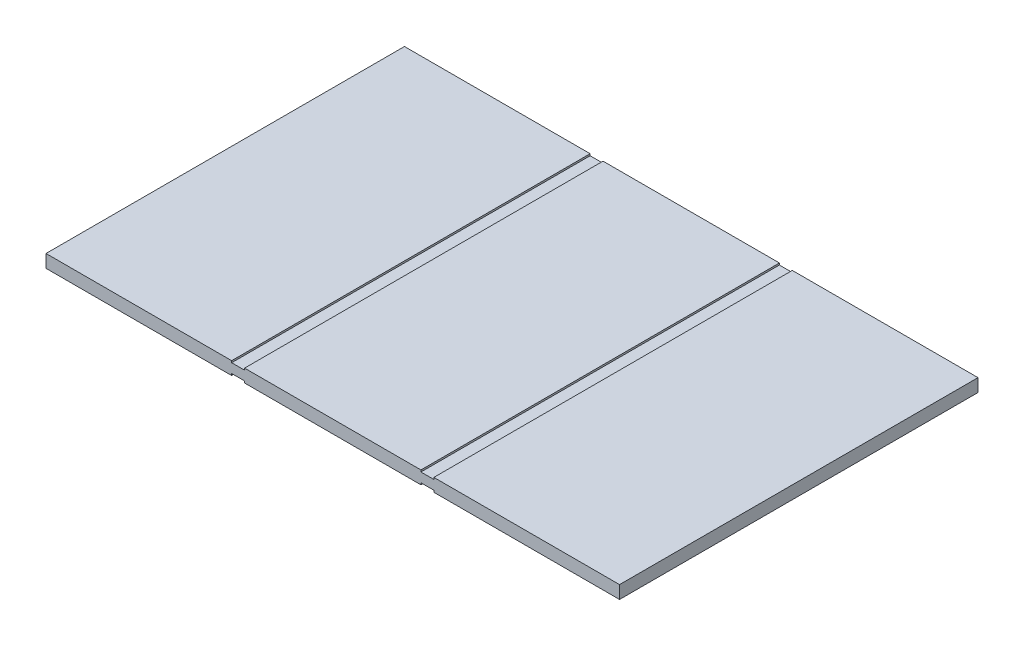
ISO-10303-21;
HEADER;
FILE_DESCRIPTION(('STEP AP214'),'2;1');
FILE_NAME('part.step','',(''),(''),'','','');
FILE_SCHEMA(('AUTOMOTIVE_DESIGN { 1 0 10303 214 1 1 1 1 }'));
ENDSEC;
DATA;
#1=APPLICATION_CONTEXT('core data for automotive mechanical design processes');
#2=APPLICATION_PROTOCOL_DEFINITION('international standard','automotive_design',2000,#1);
#3=PRODUCT_CONTEXT('',#1,'mechanical');
#4=PRODUCT('Part','Part','',(#3));
#5=PRODUCT_RELATED_PRODUCT_CATEGORY('part','',(#4));
#6=PRODUCT_DEFINITION_FORMATION('','',#4);
#7=PRODUCT_DEFINITION_CONTEXT('part definition',#1,'design');
#8=PRODUCT_DEFINITION('design','',#6,#7);
#9=PRODUCT_DEFINITION_SHAPE('','',#8);
#10=(LENGTH_UNIT() NAMED_UNIT(*) SI_UNIT(.MILLI.,.METRE.));
#11=(NAMED_UNIT(*) PLANE_ANGLE_UNIT() SI_UNIT($,.RADIAN.));
#12=(NAMED_UNIT(*) SI_UNIT($,.STERADIAN.) SOLID_ANGLE_UNIT());
#13=UNCERTAINTY_MEASURE_WITH_UNIT(LENGTH_MEASURE(1.E-05),#10,'distance_accuracy_value','');
#14=(GEOMETRIC_REPRESENTATION_CONTEXT(3) GLOBAL_UNCERTAINTY_ASSIGNED_CONTEXT((#13)) GLOBAL_UNIT_ASSIGNED_CONTEXT((#10,
#11,#12)) REPRESENTATION_CONTEXT('',''));
#15=CARTESIAN_POINT('',(0.,0.,0.));
#16=DIRECTION('',(0.,0.,1.));
#17=DIRECTION('',(1.,0.,0.));
#18=AXIS2_PLACEMENT_3D('',#15,#16,#17);
#19=CARTESIAN_POINT('',(0.,0.,0.));
#20=DIRECTION('',(0.,1.,0.));
#21=DIRECTION('',(0.,0.,1.));
#22=AXIS2_PLACEMENT_3D('',#19,#20,#21);
#23=PLANE('',#22);
#24=DIRECTION('',(-1.,0.,0.));
#25=VECTOR('',#24,1.);
#26=CARTESIAN_POINT('',(-400.,0.,-250.));
#27=LINE('',#26,#25);
#28=CARTESIAN_POINT('',(122.978931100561,0.,-250.));
#29=VERTEX_POINT('',#28);
#30=CARTESIAN_POINT('',(-123.021068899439,0.,-250.));
#31=VERTEX_POINT('',#30);
#32=EDGE_CURVE('E56',#29,#31,#27,.T.);
#33=ORIENTED_EDGE('',*,*,#32,.F.);
#34=DIRECTION('',(0.,0.,-1.));
#35=VECTOR('',#34,1.);
#36=CARTESIAN_POINT('',(122.978931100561,0.,250.));
#37=LINE('',#36,#35);
#38=CARTESIAN_POINT('',(122.978931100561,0.,250.));
#39=VERTEX_POINT('',#38);
#40=EDGE_CURVE('E176',#39,#29,#37,.T.);
#41=ORIENTED_EDGE('',*,*,#40,.F.);
#42=DIRECTION('',(1.,0.,0.));
#43=VECTOR('',#42,1.);
#44=CARTESIAN_POINT('',(-400.,0.,250.));
#45=LINE('',#44,#43);
#46=CARTESIAN_POINT('',(-123.021068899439,0.,250.));
#47=VERTEX_POINT('',#46);
#48=EDGE_CURVE('E308',#47,#39,#45,.T.);
#49=ORIENTED_EDGE('',*,*,#48,.F.);
#50=DIRECTION('',(0.,0.,1.));
#51=VECTOR('',#50,1.);
#52=CARTESIAN_POINT('',(-123.021068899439,0.,250.));
#53=LINE('',#52,#51);
#54=EDGE_CURVE('E209',#31,#47,#53,.T.);
#55=ORIENTED_EDGE('',*,*,#54,.F.);
#56=EDGE_LOOP('',(#33,#41,#49,#55));
#57=FACE_BOUND('',#56,.T.);
#58=ADVANCED_FACE('F33',(#57),#23,.F.);
#59=CARTESIAN_POINT('',(-140.999999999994,0.,-250.));
#60=VERTEX_POINT('',#59);
#61=CARTESIAN_POINT('',(-400.,0.,-250.));
#62=VERTEX_POINT('',#61);
#63=EDGE_CURVE('E310',#60,#62,#27,.T.);
#64=ORIENTED_EDGE('',*,*,#63,.F.);
#65=DIRECTION('',(0.,0.,-1.));
#66=VECTOR('',#65,1.);
#67=CARTESIAN_POINT('',(-140.999999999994,0.,250.));
#68=LINE('',#67,#66);
#69=CARTESIAN_POINT('',(-140.999999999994,0.,250.));
#70=VERTEX_POINT('',#69);
#71=EDGE_CURVE('E200',#70,#60,#68,.T.);
#72=ORIENTED_EDGE('',*,*,#71,.F.);
#73=CARTESIAN_POINT('',(-400.,0.,250.));
#74=VERTEX_POINT('',#73);
#75=EDGE_CURVE('E304',#74,#70,#45,.T.);
#76=ORIENTED_EDGE('',*,*,#75,.F.);
#77=DIRECTION('',(0.,0.,1.));
#78=VECTOR('',#77,1.);
#79=CARTESIAN_POINT('',(-400.,0.,-250.));
#80=LINE('',#79,#78);
#81=EDGE_CURVE('E276',#62,#74,#80,.T.);
#82=ORIENTED_EDGE('',*,*,#81,.F.);
#83=EDGE_LOOP('',(#64,#72,#76,#82));
#84=FACE_BOUND('',#83,.T.);
#85=ADVANCED_FACE('F380',(#84),#23,.F.);
#86=CARTESIAN_POINT('',(0.,18.,0.));
#87=DIRECTION('',(0.,1.,0.));
#88=DIRECTION('',(0.,0.,1.));
#89=AXIS2_PLACEMENT_3D('',#86,#87,#88);
#90=PLANE('',#89);
#91=DIRECTION('',(0.,0.,1.));
#92=VECTOR('',#91,1.);
#93=CARTESIAN_POINT('',(122.978931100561,18.,-250.));
#94=LINE('',#93,#92);
#95=CARTESIAN_POINT('',(122.978931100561,18.,-250.));
#96=VERTEX_POINT('',#95);
#97=CARTESIAN_POINT('',(122.978931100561,18.,250.));
#98=VERTEX_POINT('',#97);
#99=EDGE_CURVE('E223',#96,#98,#94,.T.);
#100=ORIENTED_EDGE('',*,*,#99,.F.);
#101=DIRECTION('',(-1.,0.,0.));
#102=VECTOR('',#101,1.);
#103=CARTESIAN_POINT('',(-400.,18.,-250.));
#104=LINE('',#103,#102);
#105=CARTESIAN_POINT('',(-123.021068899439,18.,-250.));
#106=VERTEX_POINT('',#105);
#107=EDGE_CURVE('E300',#96,#106,#104,.T.);
#108=ORIENTED_EDGE('',*,*,#107,.T.);
#109=DIRECTION('',(0.,0.,-1.));
#110=VECTOR('',#109,1.);
#111=CARTESIAN_POINT('',(-123.021068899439,18.,-250.));
#112=LINE('',#111,#110);
#113=CARTESIAN_POINT('',(-123.021068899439,18.,250.));
#114=VERTEX_POINT('',#113);
#115=EDGE_CURVE('E261',#114,#106,#112,.T.);
#116=ORIENTED_EDGE('',*,*,#115,.F.);
#117=DIRECTION('',(1.,0.,0.));
#118=VECTOR('',#117,1.);
#119=CARTESIAN_POINT('',(-400.,18.,250.));
#120=LINE('',#119,#118);
#121=EDGE_CURVE('E293',#114,#98,#120,.T.);
#122=ORIENTED_EDGE('',*,*,#121,.T.);
#123=EDGE_LOOP('',(#100,#108,#116,#122));
#124=FACE_BOUND('',#123,.T.);
#125=ADVANCED_FACE('F340',(#124),#90,.T.);
#126=DIRECTION('',(0.,0.,1.));
#127=VECTOR('',#126,1.);
#128=CARTESIAN_POINT('',(-141.021068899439,18.,-250.));
#129=LINE('',#128,#127);
#130=CARTESIAN_POINT('',(-141.021068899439,18.,-250.));
#131=VERTEX_POINT('',#130);
#132=CARTESIAN_POINT('',(-141.021068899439,18.,250.));
#133=VERTEX_POINT('',#132);
#134=EDGE_CURVE('E249',#131,#133,#129,.T.);
#135=ORIENTED_EDGE('',*,*,#134,.F.);
#136=CARTESIAN_POINT('',(-400.,18.,-250.));
#137=VERTEX_POINT('',#136);
#138=EDGE_CURVE('E295',#131,#137,#104,.T.);
#139=ORIENTED_EDGE('',*,*,#138,.T.);
#140=DIRECTION('',(0.,0.,1.));
#141=VECTOR('',#140,1.);
#142=CARTESIAN_POINT('',(-400.,18.,-250.));
#143=LINE('',#142,#141);
#144=CARTESIAN_POINT('',(-400.,18.,250.));
#145=VERTEX_POINT('',#144);
#146=EDGE_CURVE('E284',#137,#145,#143,.T.);
#147=ORIENTED_EDGE('',*,*,#146,.T.);
#148=EDGE_CURVE('E289',#145,#133,#120,.T.);
#149=ORIENTED_EDGE('',*,*,#148,.T.);
#150=EDGE_LOOP('',(#135,#139,#147,#149));
#151=FACE_BOUND('',#150,.T.);
#152=ADVANCED_FACE('F357',(#151),#90,.T.);
#153=CARTESIAN_POINT('',(-400.,18.,-250.));
#154=DIRECTION('',(1.,0.,0.));
#155=DIRECTION('',(0.,0.,-1.));
#156=AXIS2_PLACEMENT_3D('',#153,#154,#155);
#157=PLANE('',#156);
#158=ORIENTED_EDGE('',*,*,#81,.T.);
#159=DIRECTION('',(0.,-1.,0.));
#160=VECTOR('',#159,1.);
#161=CARTESIAN_POINT('',(-400.,18.,250.));
#162=LINE('',#161,#160);
#163=EDGE_CURVE('E11',#145,#74,#162,.T.);
#164=ORIENTED_EDGE('',*,*,#163,.F.);
#165=ORIENTED_EDGE('',*,*,#146,.F.);
#166=DIRECTION('',(0.,-1.,0.));
#167=VECTOR('',#166,1.);
#168=CARTESIAN_POINT('',(-400.,18.,-250.));
#169=LINE('',#168,#167);
#170=EDGE_CURVE('E299',#137,#62,#169,.T.);
#171=ORIENTED_EDGE('',*,*,#170,.T.);
#172=EDGE_LOOP('',(#158,#164,#165,#171));
#173=FACE_BOUND('',#172,.T.);
#174=ADVANCED_FACE('F35',(#173),#157,.F.);
#175=CARTESIAN_POINT('',(-400.,18.,250.));
#176=DIRECTION('',(0.,0.,-1.));
#177=DIRECTION('',(-1.,0.,0.));
#178=AXIS2_PLACEMENT_3D('',#175,#176,#177);
#179=PLANE('',#178);
#180=ORIENTED_EDGE('',*,*,#48,.T.);
#181=DIRECTION('',(0.,-1.,0.));
#182=VECTOR('',#181,1.);
#183=CARTESIAN_POINT('',(122.978931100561,2.5,250.));
#184=LINE('',#183,#182);
#185=CARTESIAN_POINT('',(122.978931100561,2.5,250.));
#186=VERTEX_POINT('',#185);
#187=EDGE_CURVE('E198',#186,#39,#184,.T.);
#188=ORIENTED_EDGE('',*,*,#187,.F.);
#189=DIRECTION('',(-1.,0.,0.));
#190=VECTOR('',#189,1.);
#191=CARTESIAN_POINT('',(122.978931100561,2.5,250.));
#192=LINE('',#191,#190);
#193=CARTESIAN_POINT('',(140.978931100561,2.5,250.));
#194=VERTEX_POINT('',#193);
#195=EDGE_CURVE('E178',#194,#186,#192,.T.);
#196=ORIENTED_EDGE('',*,*,#195,.F.);
#197=DIRECTION('',(0.,-1.,0.));
#198=VECTOR('',#197,1.);
#199=CARTESIAN_POINT('',(140.978931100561,2.5,250.));
#200=LINE('',#199,#198);
#201=CARTESIAN_POINT('',(140.978931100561,0.,250.));
#202=VERTEX_POINT('',#201);
#203=EDGE_CURVE('E201',#194,#202,#200,.T.);
#204=ORIENTED_EDGE('',*,*,#203,.T.);
#205=CARTESIAN_POINT('',(400.,0.,250.));
#206=VERTEX_POINT('',#205);
#207=EDGE_CURVE('E303',#202,#206,#45,.T.);
#208=ORIENTED_EDGE('',*,*,#207,.T.);
#209=DIRECTION('',(0.,-1.,0.));
#210=VECTOR('',#209,1.);
#211=CARTESIAN_POINT('',(400.,18.,250.));
#212=LINE('',#211,#210);
#213=CARTESIAN_POINT('',(400.,18.,250.));
#214=VERTEX_POINT('',#213);
#215=EDGE_CURVE('E41',#214,#206,#212,.T.);
#216=ORIENTED_EDGE('',*,*,#215,.F.);
#217=CARTESIAN_POINT('',(140.978931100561,18.,250.));
#218=VERTEX_POINT('',#217);
#219=EDGE_CURVE('E287',#218,#214,#120,.T.);
#220=ORIENTED_EDGE('',*,*,#219,.F.);
#221=DIRECTION('',(0.,1.,0.));
#222=VECTOR('',#221,1.);
#223=CARTESIAN_POINT('',(140.978931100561,15.5,250.));
#224=LINE('',#223,#222);
#225=CARTESIAN_POINT('',(140.978931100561,15.5,250.));
#226=VERTEX_POINT('',#225);
#227=EDGE_CURVE('E253',#226,#218,#224,.T.);
#228=ORIENTED_EDGE('',*,*,#227,.F.);
#229=DIRECTION('',(1.,0.,0.));
#230=VECTOR('',#229,1.);
#231=CARTESIAN_POINT('',(122.978931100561,15.5,250.));
#232=LINE('',#231,#230);
#233=CARTESIAN_POINT('',(122.978931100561,15.5,250.));
#234=VERTEX_POINT('',#233);
#235=EDGE_CURVE('E234',#234,#226,#232,.T.);
#236=ORIENTED_EDGE('',*,*,#235,.F.);
#237=DIRECTION('',(0.,1.,0.));
#238=VECTOR('',#237,1.);
#239=CARTESIAN_POINT('',(122.978931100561,15.5,250.));
#240=LINE('',#239,#238);
#241=EDGE_CURVE('E244',#234,#98,#240,.T.);
#242=ORIENTED_EDGE('',*,*,#241,.T.);
#243=ORIENTED_EDGE('',*,*,#121,.F.);
#244=DIRECTION('',(0.,1.,0.));
#245=VECTOR('',#244,1.);
#246=CARTESIAN_POINT('',(-123.021068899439,15.5,250.));
#247=LINE('',#246,#245);
#248=CARTESIAN_POINT('',(-123.021068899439,15.5,250.));
#249=VERTEX_POINT('',#248);
#250=EDGE_CURVE('E280',#249,#114,#247,.T.);
#251=ORIENTED_EDGE('',*,*,#250,.F.);
#252=DIRECTION('',(1.,0.,0.));
#253=VECTOR('',#252,1.);
#254=CARTESIAN_POINT('',(-141.021068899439,15.5,250.));
#255=LINE('',#254,#253);
#256=CARTESIAN_POINT('',(-141.021068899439,15.5,250.));
#257=VERTEX_POINT('',#256);
#258=EDGE_CURVE('E260',#257,#249,#255,.T.);
#259=ORIENTED_EDGE('',*,*,#258,.F.);
#260=DIRECTION('',(0.,1.,0.));
#261=VECTOR('',#260,1.);
#262=CARTESIAN_POINT('',(-141.021068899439,15.5,250.));
#263=LINE('',#262,#261);
#264=EDGE_CURVE('E270',#257,#133,#263,.T.);
#265=ORIENTED_EDGE('',*,*,#264,.T.);
#266=ORIENTED_EDGE('',*,*,#148,.F.);
#267=ORIENTED_EDGE('',*,*,#163,.T.);
#268=ORIENTED_EDGE('',*,*,#75,.T.);
#269=DIRECTION('',(0.,-1.,0.));
#270=VECTOR('',#269,1.);
#271=CARTESIAN_POINT('',(-140.999999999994,2.5,250.));
#272=LINE('',#271,#270);
#273=CARTESIAN_POINT('',(-140.999999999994,2.5,250.));
#274=VERTEX_POINT('',#273);
#275=EDGE_CURVE('E221',#274,#70,#272,.T.);
#276=ORIENTED_EDGE('',*,*,#275,.F.);
#277=DIRECTION('',(-1.,0.,0.));
#278=VECTOR('',#277,1.);
#279=CARTESIAN_POINT('',(-140.999999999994,2.5,250.));
#280=LINE('',#279,#278);
#281=CARTESIAN_POINT('',(-123.021068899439,2.5,250.));
#282=VERTEX_POINT('',#281);
#283=EDGE_CURVE('E215',#282,#274,#280,.T.);
#284=ORIENTED_EDGE('',*,*,#283,.F.);
#285=DIRECTION('',(0.,-1.,0.));
#286=VECTOR('',#285,1.);
#287=CARTESIAN_POINT('',(-123.021068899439,2.5,250.));
#288=LINE('',#287,#286);
#289=EDGE_CURVE('E224',#282,#47,#288,.T.);
#290=ORIENTED_EDGE('',*,*,#289,.T.);
#291=EDGE_LOOP('',(#180,#188,#196,#204,#208,#216,#220,#228,#236,#242,#243,#251,#259,#265,#266,
#267,#268,#276,#284,#290));
#292=FACE_BOUND('',#291,.T.);
#293=ADVANCED_FACE('F344',(#292),#179,.F.);
#294=CARTESIAN_POINT('',(400.,18.,-250.));
#295=DIRECTION('',(-1.,0.,0.));
#296=DIRECTION('',(0.,0.,1.));
#297=AXIS2_PLACEMENT_3D('',#294,#295,#296);
#298=PLANE('',#297);
#299=DIRECTION('',(0.,0.,-1.));
#300=VECTOR('',#299,1.);
#301=CARTESIAN_POINT('',(400.,0.,-250.));
#302=LINE('',#301,#300);
#303=CARTESIAN_POINT('',(400.,0.,-250.));
#304=VERTEX_POINT('',#303);
#305=EDGE_CURVE('E307',#206,#304,#302,.T.);
#306=ORIENTED_EDGE('',*,*,#305,.T.);
#307=DIRECTION('',(0.,-1.,0.));
#308=VECTOR('',#307,1.);
#309=CARTESIAN_POINT('',(400.,18.,-250.));
#310=LINE('',#309,#308);
#311=CARTESIAN_POINT('',(400.,18.,-250.));
#312=VERTEX_POINT('',#311);
#313=EDGE_CURVE('E314',#312,#304,#310,.T.);
#314=ORIENTED_EDGE('',*,*,#313,.F.);
#315=DIRECTION('',(0.,0.,-1.));
#316=VECTOR('',#315,1.);
#317=CARTESIAN_POINT('',(400.,18.,-250.));
#318=LINE('',#317,#316);
#319=EDGE_CURVE('E292',#214,#312,#318,.T.);
#320=ORIENTED_EDGE('',*,*,#319,.F.);
#321=ORIENTED_EDGE('',*,*,#215,.T.);
#322=EDGE_LOOP('',(#306,#314,#320,#321));
#323=FACE_BOUND('',#322,.T.);
#324=ADVANCED_FACE('F321',(#323),#298,.F.);
#325=CARTESIAN_POINT('',(-400.,18.,-250.));
#326=DIRECTION('',(0.,0.,1.));
#327=DIRECTION('',(1.,0.,0.));
#328=AXIS2_PLACEMENT_3D('',#325,#326,#327);
#329=PLANE('',#328);
#330=DIRECTION('',(1.,0.,0.));
#331=VECTOR('',#330,1.);
#332=CARTESIAN_POINT('',(122.978931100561,2.5,-250.));
#333=LINE('',#332,#331);
#334=CARTESIAN_POINT('',(122.978931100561,2.5,-250.));
#335=VERTEX_POINT('',#334);
#336=CARTESIAN_POINT('',(140.978931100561,2.5,-250.));
#337=VERTEX_POINT('',#336);
#338=EDGE_CURVE('E184',#335,#337,#333,.T.);
#339=ORIENTED_EDGE('',*,*,#338,.F.);
#340=DIRECTION('',(0.,-1.,0.));
#341=VECTOR('',#340,1.);
#342=CARTESIAN_POINT('',(122.978931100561,2.5,-250.));
#343=LINE('',#342,#341);
#344=EDGE_CURVE('E170',#335,#29,#343,.T.);
#345=ORIENTED_EDGE('',*,*,#344,.T.);
#346=ORIENTED_EDGE('',*,*,#32,.T.);
#347=DIRECTION('',(0.,-1.,0.));
#348=VECTOR('',#347,1.);
#349=CARTESIAN_POINT('',(-123.021068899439,2.5,-250.));
#350=LINE('',#349,#348);
#351=CARTESIAN_POINT('',(-123.021068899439,2.5,-250.));
#352=VERTEX_POINT('',#351);
#353=EDGE_CURVE('E227',#352,#31,#350,.T.);
#354=ORIENTED_EDGE('',*,*,#353,.F.);
#355=DIRECTION('',(1.,0.,0.));
#356=VECTOR('',#355,1.);
#357=CARTESIAN_POINT('',(-140.999999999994,2.5,-250.));
#358=LINE('',#357,#356);
#359=CARTESIAN_POINT('',(-140.999999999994,2.5,-250.));
#360=VERTEX_POINT('',#359);
#361=EDGE_CURVE('E208',#360,#352,#358,.T.);
#362=ORIENTED_EDGE('',*,*,#361,.F.);
#363=DIRECTION('',(0.,-1.,0.));
#364=VECTOR('',#363,1.);
#365=CARTESIAN_POINT('',(-140.999999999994,2.5,-250.));
#366=LINE('',#365,#364);
#367=EDGE_CURVE('E218',#360,#60,#366,.T.);
#368=ORIENTED_EDGE('',*,*,#367,.T.);
#369=ORIENTED_EDGE('',*,*,#63,.T.);
#370=ORIENTED_EDGE('',*,*,#170,.F.);
#371=ORIENTED_EDGE('',*,*,#138,.F.);
#372=DIRECTION('',(0.,1.,0.));
#373=VECTOR('',#372,1.);
#374=CARTESIAN_POINT('',(-141.021068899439,15.5,-250.));
#375=LINE('',#374,#373);
#376=CARTESIAN_POINT('',(-141.021068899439,15.5,-250.));
#377=VERTEX_POINT('',#376);
#378=EDGE_CURVE('E274',#377,#131,#375,.T.);
#379=ORIENTED_EDGE('',*,*,#378,.F.);
#380=DIRECTION('',(-1.,0.,0.));
#381=VECTOR('',#380,1.);
#382=CARTESIAN_POINT('',(-141.021068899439,15.5,-250.));
#383=LINE('',#382,#381);
#384=CARTESIAN_POINT('',(-123.021068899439,15.5,-250.));
#385=VERTEX_POINT('',#384);
#386=EDGE_CURVE('E267',#385,#377,#383,.T.);
#387=ORIENTED_EDGE('',*,*,#386,.F.);
#388=DIRECTION('',(0.,1.,0.));
#389=VECTOR('',#388,1.);
#390=CARTESIAN_POINT('',(-123.021068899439,15.5,-250.));
#391=LINE('',#390,#389);
#392=EDGE_CURVE('E277',#385,#106,#391,.T.);
#393=ORIENTED_EDGE('',*,*,#392,.T.);
#394=ORIENTED_EDGE('',*,*,#107,.F.);
#395=DIRECTION('',(0.,1.,0.));
#396=VECTOR('',#395,1.);
#397=CARTESIAN_POINT('',(122.978931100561,15.5,-250.));
#398=LINE('',#397,#396);
#399=CARTESIAN_POINT('',(122.978931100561,15.5,-250.));
#400=VERTEX_POINT('',#399);
#401=EDGE_CURVE('E247',#400,#96,#398,.T.);
#402=ORIENTED_EDGE('',*,*,#401,.F.);
#403=DIRECTION('',(-1.,0.,0.));
#404=VECTOR('',#403,1.);
#405=CARTESIAN_POINT('',(122.978931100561,15.5,-250.));
#406=LINE('',#405,#404);
#407=CARTESIAN_POINT('',(140.978931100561,15.5,-250.));
#408=VERTEX_POINT('',#407);
#409=EDGE_CURVE('E241',#408,#400,#406,.T.);
#410=ORIENTED_EDGE('',*,*,#409,.F.);
#411=DIRECTION('',(0.,1.,0.));
#412=VECTOR('',#411,1.);
#413=CARTESIAN_POINT('',(140.978931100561,15.5,-250.));
#414=LINE('',#413,#412);
#415=CARTESIAN_POINT('',(140.978931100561,18.,-250.));
#416=VERTEX_POINT('',#415);
#417=EDGE_CURVE('E250',#408,#416,#414,.T.);
#418=ORIENTED_EDGE('',*,*,#417,.T.);
#419=EDGE_CURVE('E296',#312,#416,#104,.T.);
#420=ORIENTED_EDGE('',*,*,#419,.F.);
#421=ORIENTED_EDGE('',*,*,#313,.T.);
#422=CARTESIAN_POINT('',(140.978931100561,0.,-250.));
#423=VERTEX_POINT('',#422);
#424=EDGE_CURVE('E288',#304,#423,#27,.T.);
#425=ORIENTED_EDGE('',*,*,#424,.T.);
#426=DIRECTION('',(0.,-1.,0.));
#427=VECTOR('',#426,1.);
#428=CARTESIAN_POINT('',(140.978931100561,2.5,-250.));
#429=LINE('',#428,#427);
#430=EDGE_CURVE('E48',#337,#423,#429,.T.);
#431=ORIENTED_EDGE('',*,*,#430,.F.);
#432=EDGE_LOOP('',(#339,#345,#346,#354,#362,#368,#369,#370,#371,#379,#387,#393,#394,#402,#410,
#418,#420,#421,#425,#431));
#433=FACE_BOUND('',#432,.T.);
#434=ADVANCED_FACE('F189',(#433),#329,.F.);
#435=DIRECTION('',(0.,0.,-1.));
#436=VECTOR('',#435,1.);
#437=CARTESIAN_POINT('',(140.978931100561,18.,-250.));
#438=LINE('',#437,#436);
#439=EDGE_CURVE('E235',#218,#416,#438,.T.);
#440=ORIENTED_EDGE('',*,*,#439,.F.);
#441=ORIENTED_EDGE('',*,*,#219,.T.);
#442=ORIENTED_EDGE('',*,*,#319,.T.);
#443=ORIENTED_EDGE('',*,*,#419,.T.);
#444=EDGE_LOOP('',(#440,#441,#442,#443));
#445=FACE_BOUND('',#444,.T.);
#446=ADVANCED_FACE('F333',(#445),#90,.T.);
#447=ORIENTED_EDGE('',*,*,#207,.F.);
#448=DIRECTION('',(0.,0.,1.));
#449=VECTOR('',#448,1.);
#450=CARTESIAN_POINT('',(140.978931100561,0.,250.));
#451=LINE('',#450,#449);
#452=EDGE_CURVE('E187',#423,#202,#451,.T.);
#453=ORIENTED_EDGE('',*,*,#452,.F.);
#454=ORIENTED_EDGE('',*,*,#424,.F.);
#455=ORIENTED_EDGE('',*,*,#305,.F.);
#456=EDGE_LOOP('',(#447,#453,#454,#455));
#457=FACE_BOUND('',#456,.T.);
#458=ADVANCED_FACE('F328',(#457),#23,.F.);
#459=CARTESIAN_POINT('',(-141.021068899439,15.5,-250.));
#460=DIRECTION('',(-1.,0.,0.));
#461=DIRECTION('',(0.,0.,1.));
#462=AXIS2_PLACEMENT_3D('',#459,#460,#461);
#463=PLANE('',#462);
#464=ORIENTED_EDGE('',*,*,#134,.T.);
#465=ORIENTED_EDGE('',*,*,#264,.F.);
#466=DIRECTION('',(0.,0.,1.));
#467=VECTOR('',#466,1.);
#468=CARTESIAN_POINT('',(-141.021068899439,15.5,-250.));
#469=LINE('',#468,#467);
#470=EDGE_CURVE('E257',#377,#257,#469,.T.);
#471=ORIENTED_EDGE('',*,*,#470,.F.);
#472=ORIENTED_EDGE('',*,*,#378,.T.);
#473=EDGE_LOOP('',(#464,#465,#471,#472));
#474=FACE_BOUND('',#473,.T.);
#475=ADVANCED_FACE('F366',(#474),#463,.F.);
#476=CARTESIAN_POINT('',(-123.021068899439,15.5,-250.));
#477=DIRECTION('',(1.,0.,0.));
#478=DIRECTION('',(0.,0.,-1.));
#479=AXIS2_PLACEMENT_3D('',#476,#477,#478);
#480=PLANE('',#479);
#481=ORIENTED_EDGE('',*,*,#115,.T.);
#482=ORIENTED_EDGE('',*,*,#392,.F.);
#483=DIRECTION('',(0.,0.,-1.));
#484=VECTOR('',#483,1.);
#485=CARTESIAN_POINT('',(-123.021068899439,15.5,-250.));
#486=LINE('',#485,#484);
#487=EDGE_CURVE('E264',#249,#385,#486,.T.);
#488=ORIENTED_EDGE('',*,*,#487,.F.);
#489=ORIENTED_EDGE('',*,*,#250,.T.);
#490=EDGE_LOOP('',(#481,#482,#488,#489));
#491=FACE_BOUND('',#490,.T.);
#492=ADVANCED_FACE('F370',(#491),#480,.F.);
#493=CARTESIAN_POINT('',(0.,15.5,0.));
#494=DIRECTION('',(0.,1.,0.));
#495=DIRECTION('',(0.,0.,1.));
#496=AXIS2_PLACEMENT_3D('',#493,#494,#495);
#497=PLANE('',#496);
#498=ORIENTED_EDGE('',*,*,#470,.T.);
#499=ORIENTED_EDGE('',*,*,#258,.T.);
#500=ORIENTED_EDGE('',*,*,#487,.T.);
#501=ORIENTED_EDGE('',*,*,#386,.T.);
#502=EDGE_LOOP('',(#498,#499,#500,#501));
#503=FACE_BOUND('',#502,.T.);
#504=ADVANCED_FACE('F368',(#503),#497,.T.);
#505=CARTESIAN_POINT('',(122.978931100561,15.5,-250.));
#506=DIRECTION('',(-1.,0.,0.));
#507=DIRECTION('',(0.,0.,1.));
#508=AXIS2_PLACEMENT_3D('',#505,#506,#507);
#509=PLANE('',#508);
#510=ORIENTED_EDGE('',*,*,#99,.T.);
#511=ORIENTED_EDGE('',*,*,#241,.F.);
#512=DIRECTION('',(0.,0.,1.));
#513=VECTOR('',#512,1.);
#514=CARTESIAN_POINT('',(122.978931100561,15.5,-250.));
#515=LINE('',#514,#513);
#516=EDGE_CURVE('E231',#400,#234,#515,.T.);
#517=ORIENTED_EDGE('',*,*,#516,.F.);
#518=ORIENTED_EDGE('',*,*,#401,.T.);
#519=EDGE_LOOP('',(#510,#511,#517,#518));
#520=FACE_BOUND('',#519,.T.);
#521=ADVANCED_FACE('F348',(#520),#509,.F.);
#522=CARTESIAN_POINT('',(140.978931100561,15.5,-250.));
#523=DIRECTION('',(1.,0.,0.));
#524=DIRECTION('',(0.,0.,-1.));
#525=AXIS2_PLACEMENT_3D('',#522,#523,#524);
#526=PLANE('',#525);
#527=ORIENTED_EDGE('',*,*,#439,.T.);
#528=ORIENTED_EDGE('',*,*,#417,.F.);
#529=DIRECTION('',(0.,0.,-1.));
#530=VECTOR('',#529,1.);
#531=CARTESIAN_POINT('',(140.978931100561,15.5,-250.));
#532=LINE('',#531,#530);
#533=EDGE_CURVE('E238',#226,#408,#532,.T.);
#534=ORIENTED_EDGE('',*,*,#533,.F.);
#535=ORIENTED_EDGE('',*,*,#227,.T.);
#536=EDGE_LOOP('',(#527,#528,#534,#535));
#537=FACE_BOUND('',#536,.T.);
#538=ADVANCED_FACE('F471',(#537),#526,.F.);
#539=CARTESIAN_POINT('',(0.,15.5,0.));
#540=DIRECTION('',(0.,1.,0.));
#541=DIRECTION('',(0.,0.,1.));
#542=AXIS2_PLACEMENT_3D('',#539,#540,#541);
#543=PLANE('',#542);
#544=ORIENTED_EDGE('',*,*,#516,.T.);
#545=ORIENTED_EDGE('',*,*,#235,.T.);
#546=ORIENTED_EDGE('',*,*,#533,.T.);
#547=ORIENTED_EDGE('',*,*,#409,.T.);
#548=EDGE_LOOP('',(#544,#545,#546,#547));
#549=FACE_BOUND('',#548,.T.);
#550=ADVANCED_FACE('F350',(#549),#543,.T.);
#551=CARTESIAN_POINT('',(-140.999999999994,2.5,250.));
#552=DIRECTION('',(-1.,0.,0.));
#553=DIRECTION('',(0.,0.,1.));
#554=AXIS2_PLACEMENT_3D('',#551,#552,#553);
#555=PLANE('',#554);
#556=ORIENTED_EDGE('',*,*,#71,.T.);
#557=ORIENTED_EDGE('',*,*,#367,.F.);
#558=DIRECTION('',(0.,0.,-1.));
#559=VECTOR('',#558,1.);
#560=CARTESIAN_POINT('',(-140.999999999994,2.5,250.));
#561=LINE('',#560,#559);
#562=EDGE_CURVE('E205',#274,#360,#561,.T.);
#563=ORIENTED_EDGE('',*,*,#562,.F.);
#564=ORIENTED_EDGE('',*,*,#275,.T.);
#565=EDGE_LOOP('',(#556,#557,#563,#564));
#566=FACE_BOUND('',#565,.T.);
#567=ADVANCED_FACE('F486',(#566),#555,.F.);
#568=CARTESIAN_POINT('',(-123.021068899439,2.5,250.));
#569=DIRECTION('',(1.,0.,0.));
#570=DIRECTION('',(0.,0.,-1.));
#571=AXIS2_PLACEMENT_3D('',#568,#569,#570);
#572=PLANE('',#571);
#573=ORIENTED_EDGE('',*,*,#54,.T.);
#574=ORIENTED_EDGE('',*,*,#289,.F.);
#575=DIRECTION('',(0.,0.,1.));
#576=VECTOR('',#575,1.);
#577=CARTESIAN_POINT('',(-123.021068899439,2.5,250.));
#578=LINE('',#577,#576);
#579=EDGE_CURVE('E212',#352,#282,#578,.T.);
#580=ORIENTED_EDGE('',*,*,#579,.F.);
#581=ORIENTED_EDGE('',*,*,#353,.T.);
#582=EDGE_LOOP('',(#573,#574,#580,#581));
#583=FACE_BOUND('',#582,.T.);
#584=ADVANCED_FACE('F494',(#583),#572,.F.);
#585=CARTESIAN_POINT('',(0.,2.5,0.));
#586=DIRECTION('',(0.,-1.,0.));
#587=DIRECTION('',(0.,0.,-1.));
#588=AXIS2_PLACEMENT_3D('',#585,#586,#587);
#589=PLANE('',#588);
#590=ORIENTED_EDGE('',*,*,#562,.T.);
#591=ORIENTED_EDGE('',*,*,#361,.T.);
#592=ORIENTED_EDGE('',*,*,#579,.T.);
#593=ORIENTED_EDGE('',*,*,#283,.T.);
#594=EDGE_LOOP('',(#590,#591,#592,#593));
#595=FACE_BOUND('',#594,.T.);
#596=ADVANCED_FACE('F501',(#595),#589,.T.);
#597=CARTESIAN_POINT('',(122.978931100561,2.5,250.));
#598=DIRECTION('',(-1.,0.,0.));
#599=DIRECTION('',(0.,0.,1.));
#600=AXIS2_PLACEMENT_3D('',#597,#598,#599);
#601=PLANE('',#600);
#602=ORIENTED_EDGE('',*,*,#40,.T.);
#603=ORIENTED_EDGE('',*,*,#344,.F.);
#604=DIRECTION('',(0.,0.,-1.));
#605=VECTOR('',#604,1.);
#606=CARTESIAN_POINT('',(122.978931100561,2.5,250.));
#607=LINE('',#606,#605);
#608=EDGE_CURVE('E173',#186,#335,#607,.T.);
#609=ORIENTED_EDGE('',*,*,#608,.F.);
#610=ORIENTED_EDGE('',*,*,#187,.T.);
#611=EDGE_LOOP('',(#602,#603,#609,#610));
#612=FACE_BOUND('',#611,.T.);
#613=ADVANCED_FACE('F172',(#612),#601,.F.);
#614=CARTESIAN_POINT('',(140.978931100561,2.5,250.));
#615=DIRECTION('',(1.,0.,0.));
#616=DIRECTION('',(0.,0.,-1.));
#617=AXIS2_PLACEMENT_3D('',#614,#615,#616);
#618=PLANE('',#617);
#619=ORIENTED_EDGE('',*,*,#452,.T.);
#620=ORIENTED_EDGE('',*,*,#203,.F.);
#621=DIRECTION('',(0.,0.,1.));
#622=VECTOR('',#621,1.);
#623=CARTESIAN_POINT('',(140.978931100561,2.5,250.));
#624=LINE('',#623,#622);
#625=EDGE_CURVE('E191',#337,#194,#624,.T.);
#626=ORIENTED_EDGE('',*,*,#625,.F.);
#627=ORIENTED_EDGE('',*,*,#430,.T.);
#628=EDGE_LOOP('',(#619,#620,#626,#627));
#629=FACE_BOUND('',#628,.T.);
#630=ADVANCED_FACE('F516',(#629),#618,.F.);
#631=CARTESIAN_POINT('',(0.,2.5,0.));
#632=DIRECTION('',(0.,-1.,0.));
#633=DIRECTION('',(0.,0.,-1.));
#634=AXIS2_PLACEMENT_3D('',#631,#632,#633);
#635=PLANE('',#634);
#636=ORIENTED_EDGE('',*,*,#608,.T.);
#637=ORIENTED_EDGE('',*,*,#338,.T.);
#638=ORIENTED_EDGE('',*,*,#625,.T.);
#639=ORIENTED_EDGE('',*,*,#195,.T.);
#640=EDGE_LOOP('',(#636,#637,#638,#639));
#641=FACE_BOUND('',#640,.T.);
#642=ADVANCED_FACE('F182',(#641),#635,.T.);
#643=CLOSED_SHELL('',(#58,#85,#125,#152,#174,#293,#324,#434,#446,#458,#475,#492,#504,#521,#538,
#550,#567,#584,#596,#613,#630,#642));
#644=MANIFOLD_SOLID_BREP('B2',#643);
#645=ADVANCED_BREP_SHAPE_REPRESENTATION('',(#18,#644),#14);
#646=SHAPE_DEFINITION_REPRESENTATION(#9,#645);
ENDSEC;
END-ISO-10303-21;
